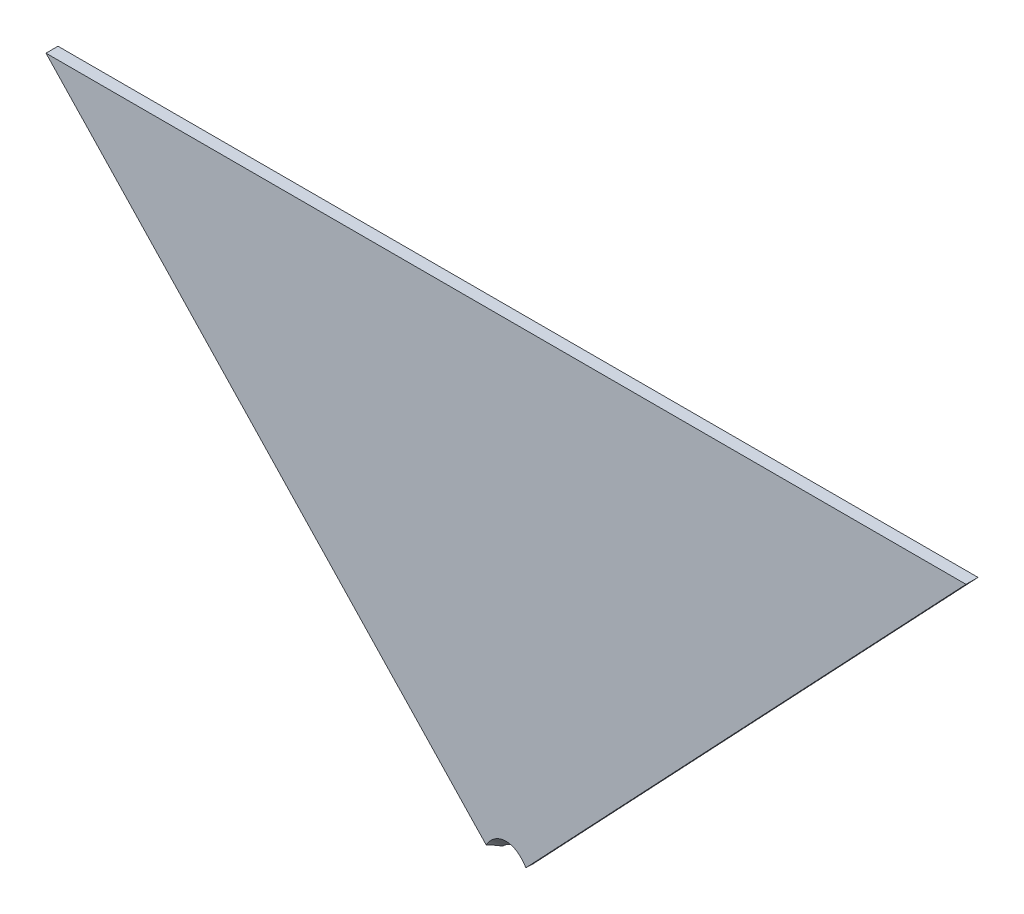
from build123d import *

# Parameters (mm, degrees)
AUFSATZ_LINEAR_AUSTRAGEN1_DEPTH = 15
SKIZZE4_R                       = 31.5
SCHNITT_LINEAR_AUSTRAGEN3_DEPTH = 1446.620102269


with BuildPart() as part:
    # Skizze1 → Aufsatz-Linear austragen1 (new body)
    with BuildSketch(Plane.XY):
        Polygon((-284.066242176, 9.706030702), (290.933757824, -598.503969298), (865.933757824, 9.706030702), align=None)
    extrude(amount=AUFSATZ_LINEAR_AUSTRAGEN1_DEPTH)

    # Skizze4 → Schnitt-Linear austragen3 (cut, through all)
    with BuildSketch(Plane(origin=(303.334277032, -960.095886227, 896.806752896), x_dir=(1, 0, 0), z_dir=(0, 0.6727432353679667, 0.7398760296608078))):
        with Locations((-12.400519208, 860.762719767)):
            Circle(SKIZZE4_R)
    extrude(amount=-SCHNITT_LINEAR_AUSTRAGEN3_DEPTH, mode=Mode.SUBTRACT)


solid = part.part
